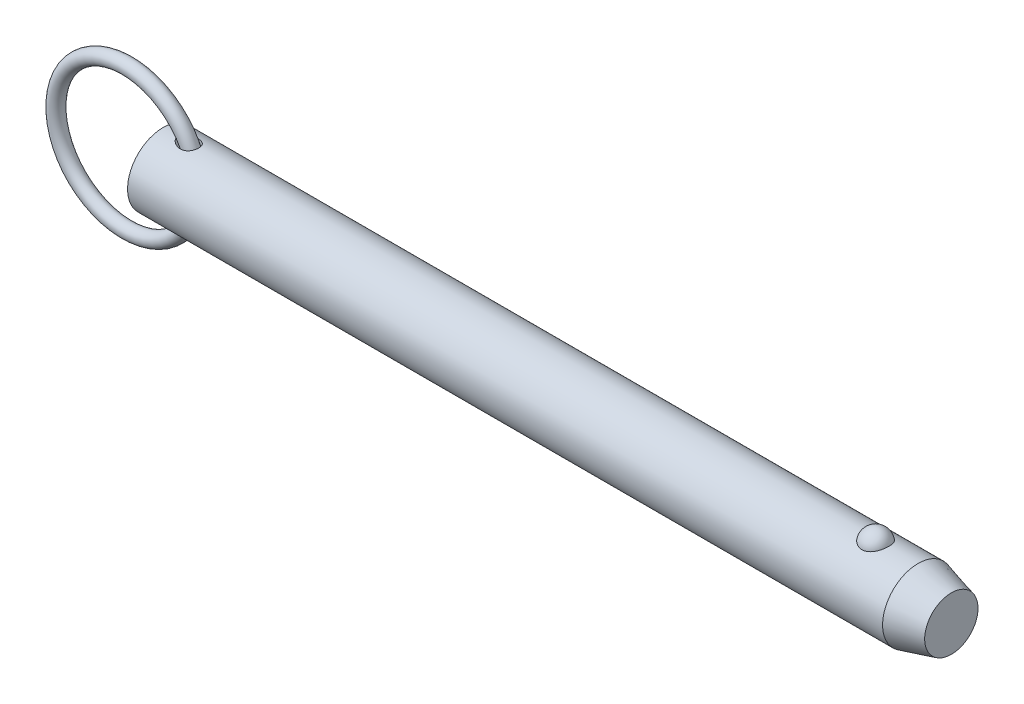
ISO-10303-21;
HEADER;
FILE_DESCRIPTION(('STEP AP214'),'2;1');
FILE_NAME('part.step','',(''),(''),'','','');
FILE_SCHEMA(('AUTOMOTIVE_DESIGN { 1 0 10303 214 1 1 1 1 }'));
ENDSEC;
DATA;
#1=APPLICATION_CONTEXT('core data for automotive mechanical design processes');
#2=APPLICATION_PROTOCOL_DEFINITION('international standard','automotive_design',2000,#1);
#3=PRODUCT_CONTEXT('',#1,'mechanical');
#4=PRODUCT('Part','Part','',(#3));
#5=PRODUCT_RELATED_PRODUCT_CATEGORY('part','',(#4));
#6=PRODUCT_DEFINITION_FORMATION('','',#4);
#7=PRODUCT_DEFINITION_CONTEXT('part definition',#1,'design');
#8=PRODUCT_DEFINITION('design','',#6,#7);
#9=PRODUCT_DEFINITION_SHAPE('','',#8);
#10=(LENGTH_UNIT() NAMED_UNIT(*) SI_UNIT(.MILLI.,.METRE.));
#11=(NAMED_UNIT(*) PLANE_ANGLE_UNIT() SI_UNIT($,.RADIAN.));
#12=(NAMED_UNIT(*) SI_UNIT($,.STERADIAN.) SOLID_ANGLE_UNIT());
#13=UNCERTAINTY_MEASURE_WITH_UNIT(LENGTH_MEASURE(1.E-05),#10,'distance_accuracy_value','');
#14=(GEOMETRIC_REPRESENTATION_CONTEXT(3) GLOBAL_UNCERTAINTY_ASSIGNED_CONTEXT((#13)) GLOBAL_UNIT_ASSIGNED_CONTEXT((#10,
#11,#12)) REPRESENTATION_CONTEXT('',''));
#15=CARTESIAN_POINT('',(0.,0.,0.));
#16=DIRECTION('',(0.,0.,1.));
#17=DIRECTION('',(1.,0.,0.));
#18=AXIS2_PLACEMENT_3D('',#15,#16,#17);
#19=CARTESIAN_POINT('',(-9.66825126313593,0.,0.));
#20=DIRECTION('',(0.,0.,1.));
#21=DIRECTION('',(1.,0.,0.));
#22=AXIS2_PLACEMENT_3D('',#19,#20,#21);
#23=TOROIDAL_SURFACE('',#22,19.05,1.905);
#24=CARTESIAN_POINT('',(11.2867487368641,0.,0.));
#25=VERTEX_POINT('',#24);
#26=VERTEX_LOOP('',#25);
#27=FACE_BOUND('',#26,.T.);
#28=ADVANCED_FACE('P0_F12',(#27),#23,.T.);
#29=CLOSED_SHELL('',(#28));
#30=MANIFOLD_SOLID_BREP('P0_B1',#29);
#31=CARTESIAN_POINT('',(0.,0.,0.));
#32=DIRECTION('',(1.,0.,0.));
#33=DIRECTION('',(0.,0.,-1.));
#34=AXIS2_PLACEMENT_3D('',#31,#32,#33);
#35=CYLINDRICAL_SURFACE('',#34,9.525);
#36=CARTESIAN_POINT('',(4.5669340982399,9.4314194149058,-1.33189820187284));
#37=CARTESIAN_POINT('',(4.70260475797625,9.41020313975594,-1.48215931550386));
#38=CARTESIAN_POINT('',(4.85555680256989,9.38755003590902,-1.61683982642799));
#39=CARTESIAN_POINT('',(5.10171959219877,9.35450554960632,-1.79512943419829));
#40=CARTESIAN_POINT('',(5.18674514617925,9.34362629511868,-1.85068909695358));
#41=CARTESIAN_POINT('',(5.3615438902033,9.32258514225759,-1.95392002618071));
#42=CARTESIAN_POINT('',(5.45131542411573,9.31242299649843,-2.00159402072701));
#43=CARTESIAN_POINT('',(5.70070211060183,9.28632120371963,-2.12033289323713));
#44=CARTESIAN_POINT('',(5.86420408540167,9.2714693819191,-2.18362944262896));
#45=CARTESIAN_POINT('',(6.19893345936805,9.24694163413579,-2.28525783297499));
#46=CARTESIAN_POINT('',(6.37015384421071,9.23726110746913,-2.32361187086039));
#47=CARTESIAN_POINT('',(6.73531776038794,9.22400982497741,-2.37575048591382));
#48=CARTESIAN_POINT('',(6.92975826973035,9.22118808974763,-2.38652934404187));
#49=CARTESIAN_POINT('',(7.21995443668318,9.22416297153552,-2.37494980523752));
#50=CARTESIAN_POINT('',(7.31643847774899,9.22635560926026,-2.366466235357));
#51=CARTESIAN_POINT('',(7.50796421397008,9.2331428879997,-2.33985028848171));
#52=CARTESIAN_POINT('',(7.6030065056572,9.23773650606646,-2.32172202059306));
#53=CARTESIAN_POINT('',(7.83273114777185,9.25183311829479,-2.26504721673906));
#54=CARTESIAN_POINT('',(7.96603028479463,9.26261470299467,-2.2209856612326));
#55=CARTESIAN_POINT('',(8.22310899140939,9.28816519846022,-2.11157306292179));
#56=CARTESIAN_POINT('',(8.34689477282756,9.30293147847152,-2.04623606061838));
#57=CARTESIAN_POINT('',(8.58136049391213,9.3349416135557,-1.89485344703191));
#58=CARTESIAN_POINT('',(8.69199721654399,9.35219324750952,-1.80874222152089));
#59=CARTESIAN_POINT('',(8.89592093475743,9.38707016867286,-1.6179918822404));
#60=CARTESIAN_POINT('',(8.98920771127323,9.40469546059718,-1.51335253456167));
#61=CARTESIAN_POINT('',(9.15057731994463,9.43713590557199,-1.29519427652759));
#62=CARTESIAN_POINT('',(9.21980158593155,9.45205440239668,-1.18253282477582));
#63=CARTESIAN_POINT('',(9.33826736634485,9.47856708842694,-0.946802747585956));
#64=CARTESIAN_POINT('',(9.38751161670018,9.49016173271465,-0.823735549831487));
#65=CARTESIAN_POINT('',(9.46423850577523,9.50859378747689,-0.572614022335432));
#66=CARTESIAN_POINT('',(9.49202393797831,9.5154972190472,-0.444656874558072));
#67=CARTESIAN_POINT('',(9.52636926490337,9.5240690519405,-0.18575268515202));
#68=CARTESIAN_POINT('',(9.53292923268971,9.52573747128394,-0.0548056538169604));
#69=CARTESIAN_POINT('',(9.52467276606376,9.52365852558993,0.206503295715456));
#70=CARTESIAN_POINT('',(9.50983454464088,9.51990564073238,0.33686448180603));
#71=CARTESIAN_POINT('',(9.45907362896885,9.50737852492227,0.593166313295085));
#72=CARTESIAN_POINT('',(9.42315106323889,9.49860432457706,0.719106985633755));
#73=CARTESIAN_POINT('',(9.33106648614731,9.4769892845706,0.962959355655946));
#74=CARTESIAN_POINT('',(9.27490839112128,9.46414923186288,1.08087260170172));
#75=CARTESIAN_POINT('',(9.14375803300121,9.43581000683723,1.30534632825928));
#76=CARTESIAN_POINT('',(9.06876720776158,9.42031103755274,1.41190767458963));
#77=CARTESIAN_POINT('',(8.90203187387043,9.38836719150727,1.61069439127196));
#78=CARTESIAN_POINT('',(8.81029913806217,9.37192298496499,1.70292975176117));
#79=CARTESIAN_POINT('',(8.61268775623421,9.33985045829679,1.87086859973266));
#80=CARTESIAN_POINT('',(8.50680947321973,9.3242221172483,1.94657251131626));
#81=CARTESIAN_POINT('',(8.28220546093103,9.29513431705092,2.08109032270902));
#82=CARTESIAN_POINT('',(8.16329919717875,9.28171415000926,2.13961034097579));
#83=CARTESIAN_POINT('',(7.91756052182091,9.25859072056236,2.23755716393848));
#84=CARTESIAN_POINT('',(7.79072606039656,9.24888842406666,2.27697900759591));
#85=CARTESIAN_POINT('',(7.52377913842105,9.23338749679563,2.33907806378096));
#86=CARTESIAN_POINT('',(7.38334767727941,9.22789571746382,2.36044900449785));
#87=CARTESIAN_POINT('',(7.10081394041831,9.22210229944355,2.3829751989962));
#88=CARTESIAN_POINT('',(6.95871103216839,9.22180269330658,2.38412253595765));
#89=CARTESIAN_POINT('',(6.65642691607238,9.22632724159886,2.36656230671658));
#90=CARTESIAN_POINT('',(6.49641694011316,9.23185415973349,2.3451317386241));
#91=CARTESIAN_POINT('',(6.18115433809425,9.24811737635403,2.28014143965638));
#92=CARTESIAN_POINT('',(6.02590710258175,9.25885936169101,2.23655754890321));
#93=CARTESIAN_POINT('',(5.69904720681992,9.28624254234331,2.12025087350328));
#94=CARTESIAN_POINT('',(5.52873601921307,9.30354853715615,2.04400672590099));
#95=CARTESIAN_POINT('',(5.20289495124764,9.34106989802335,1.86504730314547));
#96=CARTESIAN_POINT('',(5.04735968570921,9.36128419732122,1.76234172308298));
#97=CARTESIAN_POINT('',(4.7928712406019,9.39697639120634,1.55895334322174));
#98=CARTESIAN_POINT('',(4.68938704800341,9.41240250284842,1.46392900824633));
#99=CARTESIAN_POINT('',(4.4984714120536,9.44202586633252,1.25875918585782));
#100=CARTESIAN_POINT('',(4.41101129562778,9.45622528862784,1.1486413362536));
#101=CARTESIAN_POINT('',(4.27502257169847,9.47888210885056,0.940600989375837));
#102=CARTESIAN_POINT('',(4.22216329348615,9.48791121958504,0.84558680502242));
#103=CARTESIAN_POINT('',(4.1324147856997,9.50344321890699,0.648051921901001));
#104=CARTESIAN_POINT('',(4.0955118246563,9.50994827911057,0.545537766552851));
#105=CARTESIAN_POINT('',(4.04043124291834,9.51971586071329,0.334452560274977));
#106=CARTESIAN_POINT('',(4.02240728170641,9.52295176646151,0.22583927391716));
#107=CARTESIAN_POINT('',(4.00750873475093,9.52562364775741,0.00713006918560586));
#108=CARTESIAN_POINT('',(4.01062334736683,9.52506156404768,-0.102965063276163));
#109=CARTESIAN_POINT('',(4.03592967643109,9.52053221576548,-0.306944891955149));
#110=CARTESIAN_POINT('',(4.05571676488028,9.51699426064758,-0.401151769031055));
#111=CARTESIAN_POINT('',(4.10967975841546,9.5074546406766,-0.585176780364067));
#112=CARTESIAN_POINT('',(4.1438599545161,9.50145224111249,-0.674993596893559));
#113=CARTESIAN_POINT('',(4.23261356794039,9.48611703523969,-0.866116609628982));
#114=CARTESIAN_POINT('',(4.28990016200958,9.47635800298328,-0.966121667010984));
#115=CARTESIAN_POINT('',(4.41856577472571,9.45502867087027,-1.15640011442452));
#116=CARTESIAN_POINT('',(4.48996918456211,9.44345524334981,-1.24665623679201));
#117=CARTESIAN_POINT('',(4.5669340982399,9.4314194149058,-1.33189820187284));
#118=B_SPLINE_CURVE_WITH_KNOTS('',3,(#36,#37,#38,#39,#40,#41,#42,#43,#44,#45,#46,#47,#48,#49,
#50,#51,#52,#53,#54,#55,#56,#57,#58,#59,#60,#61,#62,#63,#64,#65,#66,#67,#68,#69,#70,#71,#72,#73,
#74,#75,#76,#77,#78,#79,#80,#81,#82,#83,#84,#85,#86,#87,#88,#89,#90,#91,#92,#93,#94,#95,#96,#97,
#98,#99,#100,#101,#102,#103,#104,#105,#106,#107,#108,#109,#110,#111,#112,#113,#114,#115,#116,
#117),.UNSPECIFIED.,.T.,.F.,(4,2,2,2,2,2,2,2,2,2,2,2,2,2,2,2,2,2,2,2,2,2,2,2,2,2,2,2,2,2,2,2,2,
2,2,2,2,2,2,2,4),(0.,0.609951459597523,0.916123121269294,1.22218863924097,1.74791337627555,
2.27316961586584,2.85362722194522,3.14383229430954,3.43391382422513,3.85437497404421,
4.27455920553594,4.69608835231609,5.11762282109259,5.5149005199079,5.91212379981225,
6.30363414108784,6.69514313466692,7.08705103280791,7.47895654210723,7.87078624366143,
8.26258603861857,8.65411137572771,9.04562666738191,9.44349251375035,9.84146165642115,
10.2662286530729,10.6911619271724,11.1739180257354,11.6572017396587,12.2170157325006,
12.776624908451,13.1992556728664,13.6211226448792,13.9471990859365,14.2729943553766,
14.6014211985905,14.9296802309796,15.2173810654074,15.505167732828,15.8505863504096,
16.1966070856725),.UNSPECIFIED.);
#119=CARTESIAN_POINT('',(4.5669340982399,9.4314194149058,-1.33189820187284));
#120=VERTEX_POINT('',#119);
#121=EDGE_CURVE('P1_E40',#120,#120,#118,.T.);
#122=ORIENTED_EDGE('',*,*,#121,.T.);
#123=EDGE_LOOP('',(#122));
#124=FACE_BOUND('',#123,.T.);
#125=CARTESIAN_POINT('',(202.243054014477,0.,0.));
#126=DIRECTION('',(1.,0.,0.));
#127=DIRECTION('',(0.,0.,-1.));
#128=AXIS2_PLACEMENT_3D('',#125,#126,#127);
#129=CIRCLE('',#128,9.525);
#130=CARTESIAN_POINT('',(202.243054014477,0.,-9.525));
#131=VERTEX_POINT('',#130);
#132=EDGE_CURVE('P1_E25',#131,#131,#129,.T.);
#133=ORIENTED_EDGE('',*,*,#132,.F.);
#134=EDGE_LOOP('',(#133));
#135=FACE_BOUND('',#134,.T.);
#136=CARTESIAN_POINT('',(0.,0.,0.));
#137=DIRECTION('',(1.,0.,0.));
#138=DIRECTION('',(0.,0.,-1.));
#139=AXIS2_PLACEMENT_3D('',#136,#137,#138);
#140=CIRCLE('',#139,9.525);
#141=CARTESIAN_POINT('',(0.,0.,-9.525));
#142=VERTEX_POINT('',#141);
#143=EDGE_CURVE('P1_E9',#142,#142,#140,.T.);
#144=ORIENTED_EDGE('',*,*,#143,.T.);
#145=EDGE_LOOP('',(#144));
#146=FACE_BOUND('',#145,.T.);
#147=CARTESIAN_POINT('',(190.845757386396,8.80405803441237,3.63513233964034));
#148=CARTESIAN_POINT('',(190.751676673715,8.80405953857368,3.63513053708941));
#149=CARTESIAN_POINT('',(190.657561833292,8.80561325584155,3.63137461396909));
#150=CARTESIAN_POINT('',(190.470012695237,8.81177748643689,3.61638665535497));
#151=CARTESIAN_POINT('',(190.376578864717,8.81638992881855,3.60514990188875));
#152=CARTESIAN_POINT('',(190.097945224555,8.83467114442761,3.56024627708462));
#153=CARTESIAN_POINT('',(189.914691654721,8.85278327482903,3.51538626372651));
#154=CARTESIAN_POINT('',(189.559509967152,8.89871214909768,3.39742145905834));
#155=CARTESIAN_POINT('',(189.387553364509,8.92650327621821,3.32439116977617));
#156=CARTESIAN_POINT('',(189.058707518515,8.98874819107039,3.15220244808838));
#157=CARTESIAN_POINT('',(188.901811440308,9.02319893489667,3.05305594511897));
#158=CARTESIAN_POINT('',(188.602214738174,9.09629186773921,2.82797815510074));
#159=CARTESIAN_POINT('',(188.460060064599,9.13502685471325,2.70135138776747));
#160=CARTESIAN_POINT('',(188.198299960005,9.21186572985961,2.42641932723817));
#161=CARTESIAN_POINT('',(188.078701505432,9.24996941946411,2.2781073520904));
#162=CARTESIAN_POINT('',(187.859645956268,9.32341082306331,1.95652290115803));
#163=CARTESIAN_POINT('',(187.761317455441,9.35855090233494,1.78243511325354));
#164=CARTESIAN_POINT('',(187.593819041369,9.42045142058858,1.41937246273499));
#165=CARTESIAN_POINT('',(187.524651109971,9.44721128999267,1.23039658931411));
#166=CARTESIAN_POINT('',(187.416199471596,9.48990641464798,0.840370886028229));
#167=CARTESIAN_POINT('',(187.377288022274,9.50570658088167,0.639202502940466));
#168=CARTESIAN_POINT('',(187.331555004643,9.52433146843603,0.232664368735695));
#169=CARTESIAN_POINT('',(187.324732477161,9.52715657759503,0.0272947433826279));
#170=CARTESIAN_POINT('',(187.343255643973,9.51956918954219,-0.380478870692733));
#171=CARTESIAN_POINT('',(187.368405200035,9.50923740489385,-0.582893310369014));
#172=CARTESIAN_POINT('',(187.45002537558,9.47651897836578,-0.980293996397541));
#173=CARTESIAN_POINT('',(187.506496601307,9.45413210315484,-1.17528009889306));
#174=CARTESIAN_POINT('',(187.649719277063,9.39954044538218,-1.55263697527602));
#175=CARTESIAN_POINT('',(187.736512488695,9.36732213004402,-1.73498993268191));
#176=CARTESIAN_POINT('',(187.938610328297,9.29640700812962,-2.08177763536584));
#177=CARTESIAN_POINT('',(188.053917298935,9.25770966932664,-2.24621090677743));
#178=CARTESIAN_POINT('',(188.311264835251,9.17775604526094,-2.5533833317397));
#179=CARTESIAN_POINT('',(188.453434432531,9.136488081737,-2.696011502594));
#180=CARTESIAN_POINT('',(188.76089985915,9.05620497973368,-2.95451229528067));
#181=CARTESIAN_POINT('',(188.926193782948,9.01718965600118,-3.07038711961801));
#182=CARTESIAN_POINT('',(189.272052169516,8.94680019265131,-3.26976836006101));
#183=CARTESIAN_POINT('',(189.452227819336,8.91528408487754,-3.35389750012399));
#184=CARTESIAN_POINT('',(189.825651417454,8.86272514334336,-3.49043503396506));
#185=CARTESIAN_POINT('',(190.018894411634,8.84167836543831,-3.54285537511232));
#186=CARTESIAN_POINT('',(190.402503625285,8.81348056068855,-3.61241306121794));
#187=CARTESIAN_POINT('',(190.592525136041,8.80568348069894,-3.6311933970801));
#188=CARTESIAN_POINT('',(190.973190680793,8.80289410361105,-3.63795342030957));
#189=CARTESIAN_POINT('',(191.163834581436,8.80789922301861,-3.62593932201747));
#190=CARTESIAN_POINT('',(191.534007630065,8.82974915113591,-3.57238430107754));
#191=CARTESIAN_POINT('',(191.713697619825,8.84621463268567,-3.53178890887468));
#192=CARTESIAN_POINT('',(192.063422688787,8.88875330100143,-3.42331083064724));
#193=CARTESIAN_POINT('',(192.233456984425,8.91482726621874,-3.35542593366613));
#194=CARTESIAN_POINT('',(192.563237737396,8.97448239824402,-3.19248225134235));
#195=CARTESIAN_POINT('',(192.722680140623,9.00821446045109,-3.0968647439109));
#196=CARTESIAN_POINT('',(193.023513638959,9.07935398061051,-2.88162736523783));
#197=CARTESIAN_POINT('',(193.164900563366,9.11676228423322,-2.76200196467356));
#198=CARTESIAN_POINT('',(193.43331931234,9.19347419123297,-2.49516285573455));
#199=CARTESIAN_POINT('',(193.559275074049,9.23277872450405,-2.34686614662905));
#200=CARTESIAN_POINT('',(193.785522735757,9.30737610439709,-2.03093683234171));
#201=CARTESIAN_POINT('',(193.88581004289,9.34266823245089,-1.86330077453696));
#202=CARTESIAN_POINT('',(194.061514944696,9.40674710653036,-1.50744893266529));
#203=CARTESIAN_POINT('',(194.136041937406,9.43529176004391,-1.31874876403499));
#204=CARTESIAN_POINT('',(194.25416505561,9.48144132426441,-0.930631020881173));
#205=CARTESIAN_POINT('',(194.297760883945,9.49904612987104,-0.731213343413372));
#206=CARTESIAN_POINT('',(194.353158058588,9.5215314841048,-0.327147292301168));
#207=CARTESIAN_POINT('',(194.364935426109,9.52640243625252,-0.122495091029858));
#208=CARTESIAN_POINT('',(194.356382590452,9.5228957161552,0.286018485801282));
#209=CARTESIAN_POINT('',(194.33605305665,9.5145183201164,0.489879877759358));
#210=CARTESIAN_POINT('',(194.263884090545,9.48544083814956,0.88999431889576));
#211=CARTESIAN_POINT('',(194.212199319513,9.46480124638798,1.08627971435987));
#212=CARTESIAN_POINT('',(194.078491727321,9.4133389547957,1.46682086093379));
#213=CARTESIAN_POINT('',(193.996466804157,9.38251554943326,1.65107577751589));
#214=CARTESIAN_POINT('',(193.80319292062,9.31365636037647,2.00346348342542));
#215=CARTESIAN_POINT('',(193.691783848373,9.27558138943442,2.17150083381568));
#216=CARTESIAN_POINT('',(193.442294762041,9.19638714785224,2.48563115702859));
#217=CARTESIAN_POINT('',(193.304216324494,9.15526805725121,2.63172542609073));
#218=CARTESIAN_POINT('',(193.004843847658,9.07465393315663,2.89750997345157));
#219=CARTESIAN_POINT('',(192.843610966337,9.03515496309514,3.01726776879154));
#220=CARTESIAN_POINT('',(192.501613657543,8.96227564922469,3.22732920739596));
#221=CARTESIAN_POINT('',(192.320841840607,8.92889763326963,3.31762165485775));
#222=CARTESIAN_POINT('',(191.951445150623,8.8734538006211,3.46314419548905));
#223=CARTESIAN_POINT('',(191.76332371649,8.85102983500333,3.51950082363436));
#224=CARTESIAN_POINT('',(191.47578699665,8.8266696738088,3.57993683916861));
#225=CARTESIAN_POINT('',(191.379133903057,8.82009725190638,3.5960621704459));
#226=CARTESIAN_POINT('',(191.184677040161,8.81020897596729,3.62022512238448));
#227=CARTESIAN_POINT('',(191.08687410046,8.80689090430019,3.62826825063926));
#228=CARTESIAN_POINT('',(190.941224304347,8.80445615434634,3.63416760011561));
#229=CARTESIAN_POINT('',(190.893495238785,8.80405727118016,3.63513325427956));
#230=CARTESIAN_POINT('',(190.845757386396,8.80405803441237,3.63513233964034));
#231=B_SPLINE_CURVE_WITH_KNOTS('',3,(#147,#148,#149,#150,#151,#152,#153,#154,#155,#156,#157,
#158,#159,#160,#161,#162,#163,#164,#165,#166,#167,#168,#169,#170,#171,#172,#173,#174,#175,#176,
#177,#178,#179,#180,#181,#182,#183,#184,#185,#186,#187,#188,#189,#190,#191,#192,#193,#194,#195,
#196,#197,#198,#199,#200,#201,#202,#203,#204,#205,#206,#207,#208,#209,#210,#211,#212,#213,#214,
#215,#216,#217,#218,#219,#220,#221,#222,#223,#224,#225,#226,#227,#228,#229,#230),.UNSPECIFIED.,
.T.,.F.,(4,2,2,2,2,2,2,2,2,2,2,2,2,2,2,2,2,2,2,2,2,2,2,2,2,2,2,2,2,2,2,2,2,2,2,2,2,2,2,2,2,4),
(0.,0.282202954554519,0.564584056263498,1.13017050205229,1.69427128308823,2.25811483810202,
2.83836627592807,3.41879688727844,4.02497117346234,4.63118665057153,5.24474754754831,
5.85829010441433,6.46808687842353,7.07789545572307,7.68854723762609,8.299249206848,
8.91296283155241,9.52662591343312,10.1275338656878,10.7282152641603,11.2986646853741,
11.8689989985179,12.4213015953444,12.973648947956,13.5380053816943,14.1024919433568,
14.695298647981,15.2882113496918,15.8999469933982,16.5116885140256,17.1238909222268,
17.7360805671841,18.3452748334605,18.9545113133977,19.567138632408,20.179729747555,
20.7907316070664,21.4019653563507,21.9915938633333,22.2859053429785,22.5800161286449,
22.7232098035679),.UNSPECIFIED.);
#232=CARTESIAN_POINT('',(190.845757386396,8.80405803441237,3.63513233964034));
#233=VERTEX_POINT('',#232);
#234=EDGE_CURVE('P1_E34',#233,#233,#231,.T.);
#235=ORIENTED_EDGE('',*,*,#234,.T.);
#236=EDGE_LOOP('',(#235));
#237=FACE_BOUND('',#236,.T.);
#238=CARTESIAN_POINT('',(4.5669340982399,-9.4314194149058,-1.33189820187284));
#239=CARTESIAN_POINT('',(4.48932984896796,-9.4435553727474,-1.24594548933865));
#240=CARTESIAN_POINT('',(4.41737309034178,-9.45522193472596,-1.1548795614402));
#241=CARTESIAN_POINT('',(4.28781047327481,-9.47670896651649,-0.962782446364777));
#242=CARTESIAN_POINT('',(4.23019403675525,-9.48653079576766,-0.861758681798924));
#243=CARTESIAN_POINT('',(4.132545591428,-9.5034118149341,-0.649723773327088));
#244=CARTESIAN_POINT('',(4.09271158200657,-9.51043980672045,-0.538615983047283));
#245=CARTESIAN_POINT('',(4.04973167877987,-9.51806966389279,-0.367764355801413));
#246=CARTESIAN_POINT('',(4.03820037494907,-9.52012756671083,-0.310118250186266));
#247=CARTESIAN_POINT('',(4.02100287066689,-9.52320274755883,-0.193935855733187));
#248=CARTESIAN_POINT('',(4.0153356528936,-9.52422020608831,-0.135399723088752));
#249=CARTESIAN_POINT('',(4.0081707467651,-9.52550497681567,0.0247266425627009));
#250=CARTESIAN_POINT('',(4.0127049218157,-9.52468821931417,0.126661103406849));
#251=CARTESIAN_POINT('',(4.03954973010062,-9.51988506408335,0.328012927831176));
#252=CARTESIAN_POINT('',(4.06186450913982,-9.51589792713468,0.427429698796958));
#253=CARTESIAN_POINT('',(4.12088980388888,-9.50548528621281,0.616362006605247));
#254=CARTESIAN_POINT('',(4.15684838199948,-9.49918763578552,0.706123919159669));
#255=CARTESIAN_POINT('',(4.24094647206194,-9.48470618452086,0.87952277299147));
#256=CARTESIAN_POINT('',(4.28909090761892,-9.47652162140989,0.963157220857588));
#257=CARTESIAN_POINT('',(4.42295891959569,-9.45426317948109,1.16513741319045));
#258=CARTESIAN_POINT('',(4.51523752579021,-9.43933320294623,1.27905352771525));
#259=CARTESIAN_POINT('',(4.71682295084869,-9.40825940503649,1.49055892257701));
#260=CARTESIAN_POINT('',(4.82617286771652,-9.39211256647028,1.58810554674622));
#261=CARTESIAN_POINT('',(5.09064226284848,-9.35555264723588,1.79246125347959));
#262=CARTESIAN_POINT('',(5.2499041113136,-9.33524115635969,1.89393122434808));
#263=CARTESIAN_POINT('',(5.58309255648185,-9.29785396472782,2.06968659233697));
#264=CARTESIAN_POINT('',(5.75702897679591,-9.28078045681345,2.14395359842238));
#265=CARTESIAN_POINT('',(6.11646882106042,-9.25213303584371,2.26440412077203));
#266=CARTESIAN_POINT('',(6.30205582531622,-9.2406056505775,2.31035092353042));
#267=CARTESIAN_POINT('',(6.67856093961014,-9.22541807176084,2.37029728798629));
#268=CARTESIAN_POINT('',(6.86947045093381,-9.22174585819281,2.38434566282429));
#269=CARTESIAN_POINT('',(7.21217144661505,-9.22344239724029,2.37775005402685));
#270=CARTESIAN_POINT('',(7.36409439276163,-9.22713860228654,2.36352577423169));
#271=CARTESIAN_POINT('',(7.66346227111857,-9.24048072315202,2.31082299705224));
#272=CARTESIAN_POINT('',(7.81090958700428,-9.25012341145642,2.27235765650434));
#273=CARTESIAN_POINT('',(8.09730316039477,-9.2746609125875,2.17003648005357));
#274=CARTESIAN_POINT('',(8.23619652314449,-9.28958517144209,2.10603803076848));
#275=CARTESIAN_POINT('',(8.49918675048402,-9.32290326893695,1.95324442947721));
#276=CARTESIAN_POINT('',(8.62328895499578,-9.34129584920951,1.86445826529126));
#277=CARTESIAN_POINT('',(8.84006515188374,-9.37706953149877,1.67466761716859));
#278=CARTESIAN_POINT('',(8.93465172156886,-9.39436331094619,1.57582357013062));
#279=CARTESIAN_POINT('',(9.10490234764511,-9.42761680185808,1.36280955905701));
#280=CARTESIAN_POINT('',(9.18057146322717,-9.44357686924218,1.24864370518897));
#281=CARTESIAN_POINT('',(9.30789178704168,-9.47159985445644,1.01379272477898));
#282=CARTESIAN_POINT('',(9.36045544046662,-9.48380365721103,0.893617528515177));
#283=CARTESIAN_POINT('',(9.44498362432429,-9.50388751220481,0.64589020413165));
#284=CARTESIAN_POINT('',(9.47694947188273,-9.51176784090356,0.518338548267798));
#285=CARTESIAN_POINT('',(9.51944262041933,-9.52232073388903,0.260103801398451));
#286=CARTESIAN_POINT('',(9.53006646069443,-9.52501674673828,0.129437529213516));
#287=CARTESIAN_POINT('',(9.52993291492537,-9.52498309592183,-0.131885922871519));
#288=CARTESIAN_POINT('',(9.51917525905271,-9.52225336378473,-0.262543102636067));
#289=CARTESIAN_POINT('',(9.47648788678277,-9.51165418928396,-0.520312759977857));
#290=CARTESIAN_POINT('',(9.44453086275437,-9.50377811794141,-0.647420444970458));
#291=CARTESIAN_POINT('',(9.36015568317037,-9.48373425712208,-0.894290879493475));
#292=CARTESIAN_POINT('',(9.30773827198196,-9.47156662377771,-1.01405389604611));
#293=CARTESIAN_POINT('',(9.18380895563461,-9.44428888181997,-1.24269386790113));
#294=CARTESIAN_POINT('',(9.11232064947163,-9.42918241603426,-1.35158405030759));
#295=CARTESIAN_POINT('',(8.9521268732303,-9.39767706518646,-1.55562459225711));
#296=CARTESIAN_POINT('',(8.86342281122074,-9.3812782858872,-1.65077607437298));
#297=CARTESIAN_POINT('',(8.67104443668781,-9.34891827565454,-1.8251751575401));
#298=CARTESIAN_POINT('',(8.56732858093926,-9.33295841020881,-1.90437711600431));
#299=CARTESIAN_POINT('',(8.3481843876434,-9.30317889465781,-2.0449122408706));
#300=CARTESIAN_POINT('',(8.23275529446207,-9.28935938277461,-2.10624425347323));
#301=CARTESIAN_POINT('',(7.9896124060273,-9.26475003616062,-2.2120340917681));
#302=CARTESIAN_POINT('',(7.86162088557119,-9.25407358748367,-2.25587700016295));
#303=CARTESIAN_POINT('',(7.60027499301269,-9.23720810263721,-2.32397032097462));
#304=CARTESIAN_POINT('',(7.46691858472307,-9.23102078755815,-2.34821321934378));
#305=CARTESIAN_POINT('',(7.18516230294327,-9.22302718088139,-2.37943079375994));
#306=CARTESIAN_POINT('',(7.03654454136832,-9.22169704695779,-2.38452997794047));
#307=CARTESIAN_POINT('',(6.74015049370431,-9.22442327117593,-2.37395141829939));
#308=CARTESIAN_POINT('',(6.5923745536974,-9.22848170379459,-2.35826567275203));
#309=CARTESIAN_POINT('',(6.27762777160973,-9.2422287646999,-2.30385559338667));
#310=CARTESIAN_POINT('',(6.11124715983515,-9.25269504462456,-2.26192683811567));
#311=CARTESIAN_POINT('',(5.78635920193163,-9.27830776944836,-2.15445569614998));
#312=CARTESIAN_POINT('',(5.62786567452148,-9.29346211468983,-2.08887341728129));
#313=CARTESIAN_POINT('',(5.39013065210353,-9.31931237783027,-1.96924953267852));
#314=CARTESIAN_POINT('',(5.30683088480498,-9.32901725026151,-1.92292485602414));
#315=CARTESIAN_POINT('',(5.14455801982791,-9.34899035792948,-1.82334419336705));
#316=CARTESIAN_POINT('',(5.06558607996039,-9.35925874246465,-1.77008636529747));
#317=CARTESIAN_POINT('',(4.83670950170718,-9.39034445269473,-1.60010986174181));
#318=CARTESIAN_POINT('',(4.69422471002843,-9.41151337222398,-1.47288240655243));
#319=CARTESIAN_POINT('',(4.5669340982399,-9.4314194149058,-1.33189820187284));
#320=B_SPLINE_CURVE_WITH_KNOTS('',3,(#238,#239,#240,#241,#242,#243,#244,#245,#246,#247,#248,
#249,#250,#251,#252,#253,#254,#255,#256,#257,#258,#259,#260,#261,#262,#263,#264,#265,#266,#267,
#268,#269,#270,#271,#272,#273,#274,#275,#276,#277,#278,#279,#280,#281,#282,#283,#284,#285,#286,
#287,#288,#289,#290,#291,#292,#293,#294,#295,#296,#297,#298,#299,#300,#301,#302,#303,#304,#305,
#306,#307,#308,#309,#310,#311,#312,#313,#314,#315,#316,#317,#318,#319),.UNSPECIFIED.,.T.,.F.,(4,
2,2,2,2,2,2,2,2,2,2,2,2,2,2,2,2,2,2,2,2,2,2,2,2,2,2,2,2,2,2,2,2,2,2,2,2,2,2,2,4),(0.,
0.348900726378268,0.697543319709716,1.0499765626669,1.22617690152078,1.40234666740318,
1.70666745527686,2.01105922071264,2.30066493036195,2.59038784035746,3.03001384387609,
3.47076822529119,4.03766594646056,4.60494622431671,5.17690598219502,5.74798989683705,
6.20400848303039,6.65977977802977,7.11813321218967,7.57632066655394,7.98791759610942,
8.39940433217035,8.79273459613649,9.18603970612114,9.57756168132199,9.96908859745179,
10.3611208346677,10.7531388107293,11.1446739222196,11.536177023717,11.9287850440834,
12.3214184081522,12.7268448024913,13.1324265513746,13.5768390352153,14.0214226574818,
14.5351685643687,15.0497849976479,15.3368801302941,15.6240516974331,16.1963372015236),.UNSPECIFIED.);
#321=CARTESIAN_POINT('',(4.5669340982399,-9.4314194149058,-1.33189820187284));
#322=VERTEX_POINT('',#321);
#323=EDGE_CURVE('P1_E17',#322,#322,#320,.T.);
#324=ORIENTED_EDGE('',*,*,#323,.T.);
#325=EDGE_LOOP('',(#324));
#326=FACE_BOUND('',#325,.T.);
#327=ADVANCED_FACE('P1_F13',(#124,#135,#146,#237,#326),#35,.T.);
#328=CARTESIAN_POINT('',(0.,0.,0.));
#329=DIRECTION('',(-1.,0.,0.));
#330=DIRECTION('',(0.,0.,1.));
#331=AXIS2_PLACEMENT_3D('',#328,#329,#330);
#332=PLANE('',#331);
#333=ORIENTED_EDGE('',*,*,#143,.F.);
#334=EDGE_LOOP('',(#333));
#335=FACE_BOUND('',#334,.T.);
#336=ADVANCED_FACE('P1_F15',(#335),#332,.T.);
#337=CARTESIAN_POINT('',(211.13,0.,0.));
#338=DIRECTION('',(-1.,0.,0.));
#339=DIRECTION('',(0.,0.,1.));
#340=AXIS2_PLACEMENT_3D('',#337,#338,#339);
#341=CONICAL_SURFACE('',#340,7.14375000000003,0.26179938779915);
#342=ORIENTED_EDGE('',*,*,#132,.T.);
#343=EDGE_LOOP('',(#342));
#344=FACE_BOUND('',#343,.T.);
#345=CARTESIAN_POINT('',(211.13,0.,0.));
#346=DIRECTION('',(1.,0.,0.));
#347=DIRECTION('',(0.,0.,-1.));
#348=AXIS2_PLACEMENT_3D('',#345,#346,#347);
#349=CIRCLE('',#348,7.14375000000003);
#350=CARTESIAN_POINT('',(211.13,0.,-7.14375000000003));
#351=VERTEX_POINT('',#350);
#352=EDGE_CURVE('P1_E30',#351,#351,#349,.T.);
#353=ORIENTED_EDGE('',*,*,#352,.F.);
#354=EDGE_LOOP('',(#353));
#355=FACE_BOUND('',#354,.T.);
#356=ADVANCED_FACE('P1_F55',(#344,#355),#341,.T.);
#357=CARTESIAN_POINT('',(211.13,7.14375000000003,0.));
#358=DIRECTION('',(1.,0.,0.));
#359=DIRECTION('',(0.,0.,-1.));
#360=AXIS2_PLACEMENT_3D('',#357,#358,#359);
#361=PLANE('',#360);
#362=ORIENTED_EDGE('',*,*,#352,.T.);
#363=EDGE_LOOP('',(#362));
#364=FACE_BOUND('',#363,.T.);
#365=ADVANCED_FACE('P1_F51',(#364),#361,.T.);
#366=CARTESIAN_POINT('',(190.845757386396,8.5725,0.));
#367=DIRECTION('',(-1.,0.,0.));
#368=DIRECTION('',(0.,1.,0.));
#369=AXIS2_PLACEMENT_3D('',#366,#367,#368);
#370=SPHERICAL_SURFACE('',#369,3.64249999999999);
#371=ORIENTED_EDGE('',*,*,#234,.F.);
#372=EDGE_LOOP('',(#371));
#373=FACE_BOUND('',#372,.T.);
#374=ADVANCED_FACE('P1_F46',(#373),#370,.T.);
#375=CARTESIAN_POINT('',(-9.66825126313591,0.,0.));
#376=DIRECTION('',(0.,0.,1.));
#377=DIRECTION('',(1.,0.,0.));
#378=AXIS2_PLACEMENT_3D('',#375,#376,#377);
#379=TOROIDAL_SURFACE('',#378,19.05,2.38125);
#380=ORIENTED_EDGE('',*,*,#323,.F.);
#381=EDGE_LOOP('',(#380));
#382=FACE_BOUND('',#381,.T.);
#383=ORIENTED_EDGE('',*,*,#121,.F.);
#384=EDGE_LOOP('',(#383));
#385=FACE_BOUND('',#384,.T.);
#386=ADVANCED_FACE('P1_F50',(#382,#385),#379,.F.);
#387=CLOSED_SHELL('',(#327,#336,#356,#365,#374,#386));
#388=MANIFOLD_SOLID_BREP('P1_B1',#387);
#389=ADVANCED_BREP_SHAPE_REPRESENTATION('',(#18,#30,#388),#14);
#390=SHAPE_DEFINITION_REPRESENTATION(#9,#389);
ENDSEC;
END-ISO-10303-21;
